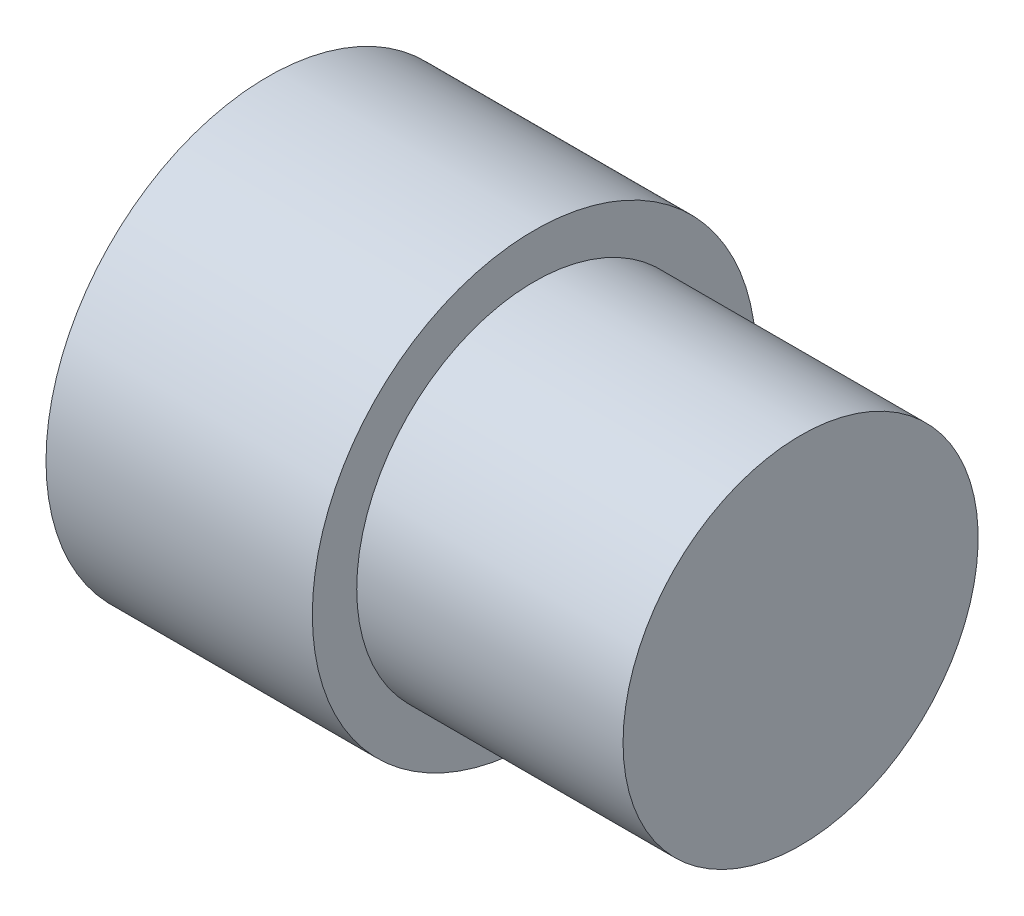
from build123d import *


with BuildPart() as part:
    # Sketch1 → Revolve1 (revolve)
    with BuildSketch(Plane(origin=(0, 0, 0), x_dir=(1, 0, 0), z_dir=(0, 1, 0)), mode=Mode.PRIVATE) as revolve1_sk:
        Polygon((0, 0), (6, 0), (6, 2), (3, 2), (3, 2.5), (0, 2.5), align=None)
    revolve(revolve1_sk.sketch.rotate(Axis((0, 0, 0), (1, 0, 0)), 180), axis=Axis((0, 0, 0), (1, 0, 0)))


solid = part.part
